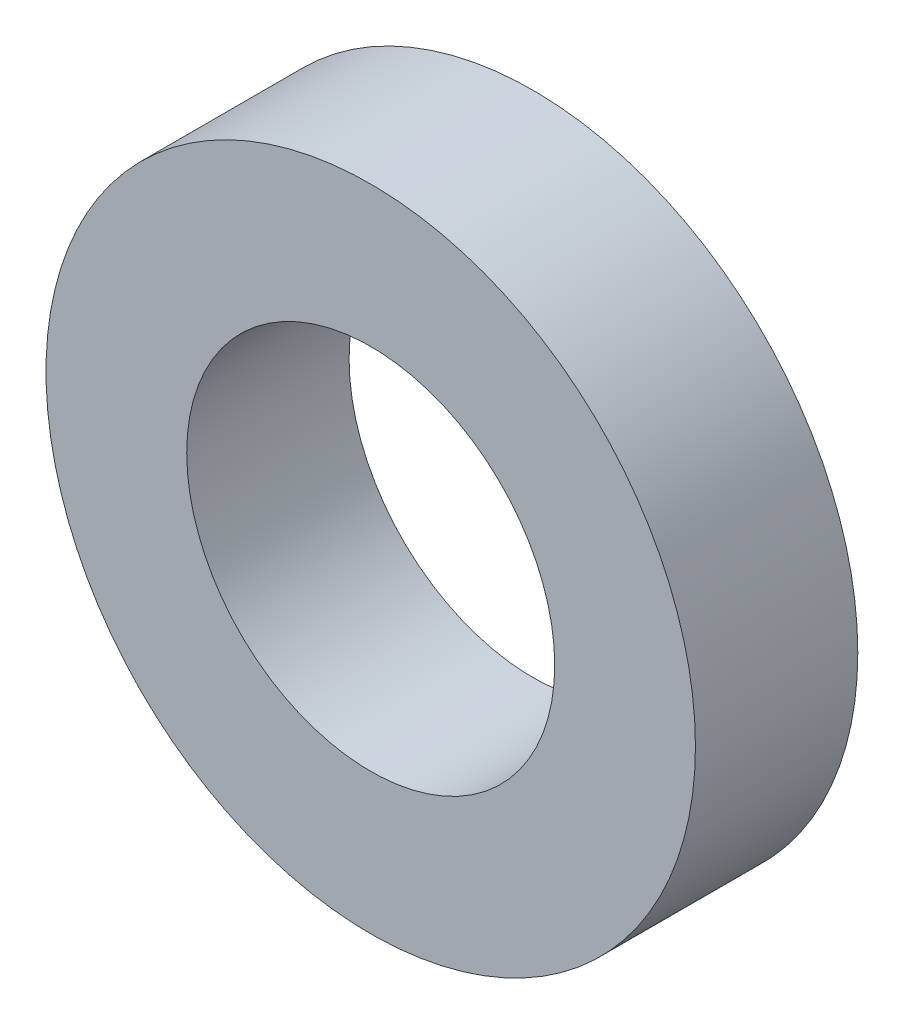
ISO-10303-21;
HEADER;
FILE_DESCRIPTION(('STEP AP214'),'2;1');
FILE_NAME('part.step','',(''),(''),'','','');
FILE_SCHEMA(('AUTOMOTIVE_DESIGN { 1 0 10303 214 1 1 1 1 }'));
ENDSEC;
DATA;
#1=APPLICATION_CONTEXT('core data for automotive mechanical design processes');
#2=APPLICATION_PROTOCOL_DEFINITION('international standard','automotive_design',2000,#1);
#3=PRODUCT_CONTEXT('',#1,'mechanical');
#4=PRODUCT('Part','Part','',(#3));
#5=PRODUCT_RELATED_PRODUCT_CATEGORY('part','',(#4));
#6=PRODUCT_DEFINITION_FORMATION('','',#4);
#7=PRODUCT_DEFINITION_CONTEXT('part definition',#1,'design');
#8=PRODUCT_DEFINITION('design','',#6,#7);
#9=PRODUCT_DEFINITION_SHAPE('','',#8);
#10=(LENGTH_UNIT() NAMED_UNIT(*) SI_UNIT(.MILLI.,.METRE.));
#11=(NAMED_UNIT(*) PLANE_ANGLE_UNIT() SI_UNIT($,.RADIAN.));
#12=(NAMED_UNIT(*) SI_UNIT($,.STERADIAN.) SOLID_ANGLE_UNIT());
#13=UNCERTAINTY_MEASURE_WITH_UNIT(LENGTH_MEASURE(1.E-05),#10,'distance_accuracy_value','');
#14=(GEOMETRIC_REPRESENTATION_CONTEXT(3) GLOBAL_UNCERTAINTY_ASSIGNED_CONTEXT((#13)) GLOBAL_UNIT_ASSIGNED_CONTEXT((#10,
#11,#12)) REPRESENTATION_CONTEXT('',''));
#15=CARTESIAN_POINT('',(0.,0.,0.));
#16=DIRECTION('',(0.,0.,1.));
#17=DIRECTION('',(1.,0.,0.));
#18=AXIS2_PLACEMENT_3D('',#15,#16,#17);
#19=CARTESIAN_POINT('',(0.,0.,1.5));
#20=DIRECTION('',(0.,0.,1.));
#21=DIRECTION('',(1.,0.,0.));
#22=AXIS2_PLACEMENT_3D('',#19,#20,#21);
#23=PLANE('',#22);
#24=CARTESIAN_POINT('',(0.,0.,1.5));
#25=DIRECTION('',(0.,0.,1.));
#26=DIRECTION('',(1.,0.,0.));
#27=AXIS2_PLACEMENT_3D('',#24,#25,#26);
#28=CIRCLE('',#27,3.);
#29=CARTESIAN_POINT('',(3.,0.,1.5));
#30=VERTEX_POINT('',#29);
#31=EDGE_CURVE('E10',#30,#30,#28,.T.);
#32=ORIENTED_EDGE('',*,*,#31,.T.);
#33=EDGE_LOOP('',(#32));
#34=FACE_BOUND('',#33,.T.);
#35=CARTESIAN_POINT('',(0.,0.,1.5));
#36=DIRECTION('',(0.,0.,1.));
#37=DIRECTION('',(1.,0.,0.));
#38=AXIS2_PLACEMENT_3D('',#35,#36,#37);
#39=CIRCLE('',#38,1.7);
#40=CARTESIAN_POINT('',(1.7,0.,1.5));
#41=VERTEX_POINT('',#40);
#42=EDGE_CURVE('E44',#41,#41,#39,.T.);
#43=ORIENTED_EDGE('',*,*,#42,.F.);
#44=EDGE_LOOP('',(#43));
#45=FACE_BOUND('',#44,.T.);
#46=ADVANCED_FACE('F33',(#34,#45),#23,.T.);
#47=CARTESIAN_POINT('',(0.,0.,0.));
#48=DIRECTION('',(0.,0.,1.));
#49=DIRECTION('',(1.,0.,0.));
#50=AXIS2_PLACEMENT_3D('',#47,#48,#49);
#51=PLANE('',#50);
#52=CARTESIAN_POINT('',(0.,0.,0.));
#53=DIRECTION('',(0.,0.,1.));
#54=DIRECTION('',(1.,0.,0.));
#55=AXIS2_PLACEMENT_3D('',#52,#53,#54);
#56=CIRCLE('',#55,3.);
#57=CARTESIAN_POINT('',(3.,0.,0.));
#58=VERTEX_POINT('',#57);
#59=EDGE_CURVE('E37',#58,#58,#56,.T.);
#60=ORIENTED_EDGE('',*,*,#59,.F.);
#61=EDGE_LOOP('',(#60));
#62=FACE_BOUND('',#61,.T.);
#63=CARTESIAN_POINT('',(0.,0.,0.));
#64=DIRECTION('',(0.,0.,1.));
#65=DIRECTION('',(1.,0.,0.));
#66=AXIS2_PLACEMENT_3D('',#63,#64,#65);
#67=CIRCLE('',#66,1.7);
#68=CARTESIAN_POINT('',(1.7,0.,0.));
#69=VERTEX_POINT('',#68);
#70=EDGE_CURVE('E46',#69,#69,#67,.T.);
#71=ORIENTED_EDGE('',*,*,#70,.T.);
#72=EDGE_LOOP('',(#71));
#73=FACE_BOUND('',#72,.T.);
#74=ADVANCED_FACE('F56',(#62,#73),#51,.F.);
#75=CARTESIAN_POINT('',(0.,0.,1.5));
#76=DIRECTION('',(0.,0.,-1.));
#77=DIRECTION('',(-1.,0.,0.));
#78=AXIS2_PLACEMENT_3D('',#75,#76,#77);
#79=CYLINDRICAL_SURFACE('',#78,3.);
#80=ORIENTED_EDGE('',*,*,#31,.F.);
#81=EDGE_LOOP('',(#80));
#82=FACE_BOUND('',#81,.T.);
#83=ORIENTED_EDGE('',*,*,#59,.T.);
#84=EDGE_LOOP('',(#83));
#85=FACE_BOUND('',#84,.T.);
#86=ADVANCED_FACE('F35',(#82,#85),#79,.T.);
#87=CARTESIAN_POINT('',(0.,0.,1.5));
#88=DIRECTION('',(0.,0.,-1.));
#89=DIRECTION('',(-1.,0.,0.));
#90=AXIS2_PLACEMENT_3D('',#87,#88,#89);
#91=CYLINDRICAL_SURFACE('',#90,1.7);
#92=ORIENTED_EDGE('',*,*,#42,.T.);
#93=EDGE_LOOP('',(#92));
#94=FACE_BOUND('',#93,.T.);
#95=ORIENTED_EDGE('',*,*,#70,.F.);
#96=EDGE_LOOP('',(#95));
#97=FACE_BOUND('',#96,.T.);
#98=ADVANCED_FACE('F52',(#94,#97),#91,.F.);
#99=CLOSED_SHELL('',(#46,#74,#86,#98));
#100=MANIFOLD_SOLID_BREP('B2',#99);
#101=ADVANCED_BREP_SHAPE_REPRESENTATION('',(#18,#100),#14);
#102=SHAPE_DEFINITION_REPRESENTATION(#9,#101);
ENDSEC;
END-ISO-10303-21;
